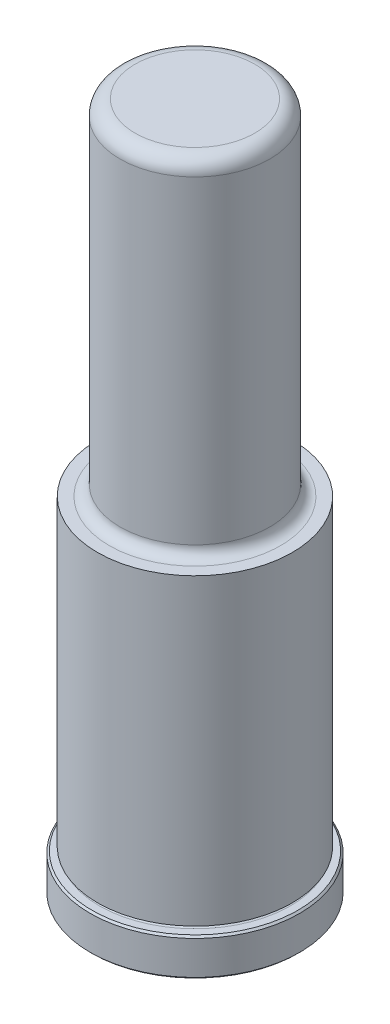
ISO-10303-21;
HEADER;
FILE_DESCRIPTION(('STEP AP214'),'2;1');
FILE_NAME('part.step','',(''),(''),'','','');
FILE_SCHEMA(('AUTOMOTIVE_DESIGN { 1 0 10303 214 1 1 1 1 }'));
ENDSEC;
DATA;
#1=APPLICATION_CONTEXT('core data for automotive mechanical design processes');
#2=APPLICATION_PROTOCOL_DEFINITION('international standard','automotive_design',2000,#1);
#3=PRODUCT_CONTEXT('',#1,'mechanical');
#4=PRODUCT('Part','Part','',(#3));
#5=PRODUCT_RELATED_PRODUCT_CATEGORY('part','',(#4));
#6=PRODUCT_DEFINITION_FORMATION('','',#4);
#7=PRODUCT_DEFINITION_CONTEXT('part definition',#1,'design');
#8=PRODUCT_DEFINITION('design','',#6,#7);
#9=PRODUCT_DEFINITION_SHAPE('','',#8);
#10=(LENGTH_UNIT() NAMED_UNIT(*) SI_UNIT(.MILLI.,.METRE.));
#11=(NAMED_UNIT(*) PLANE_ANGLE_UNIT() SI_UNIT($,.RADIAN.));
#12=(NAMED_UNIT(*) SI_UNIT($,.STERADIAN.) SOLID_ANGLE_UNIT());
#13=UNCERTAINTY_MEASURE_WITH_UNIT(LENGTH_MEASURE(1.E-05),#10,'distance_accuracy_value','');
#14=(GEOMETRIC_REPRESENTATION_CONTEXT(3) GLOBAL_UNCERTAINTY_ASSIGNED_CONTEXT((#13)) GLOBAL_UNIT_ASSIGNED_CONTEXT((#10,
#11,#12)) REPRESENTATION_CONTEXT('',''));
#15=CARTESIAN_POINT('',(0.,0.,0.));
#16=DIRECTION('',(0.,0.,1.));
#17=DIRECTION('',(1.,0.,0.));
#18=AXIS2_PLACEMENT_3D('',#15,#16,#17);
#19=CARTESIAN_POINT('',(0.,0.,0.));
#20=DIRECTION('',(0.,1.,0.));
#21=DIRECTION('',(0.,0.,1.));
#22=AXIS2_PLACEMENT_3D('',#19,#20,#21);
#23=PLANE('',#22);
#24=CARTESIAN_POINT('',(0.,0.,0.));
#25=DIRECTION('',(0.,1.,0.));
#26=DIRECTION('',(0.,0.,1.));
#27=AXIS2_PLACEMENT_3D('',#24,#25,#26);
#28=CIRCLE('',#27,21.844);
#29=CARTESIAN_POINT('',(0.,0.,21.844));
#30=VERTEX_POINT('',#29);
#31=EDGE_CURVE('E46',#30,#30,#28,.F.);
#32=ORIENTED_EDGE('',*,*,#31,.T.);
#33=EDGE_LOOP('',(#32));
#34=FACE_BOUND('',#33,.T.);
#35=ADVANCED_FACE('F31',(#34),#23,.F.);
#36=CARTESIAN_POINT('',(0.,0.,0.));
#37=DIRECTION('',(0.,1.,0.));
#38=DIRECTION('',(0.,0.,1.));
#39=AXIS2_PLACEMENT_3D('',#36,#37,#38);
#40=CYLINDRICAL_SURFACE('',#39,22.225);
#41=CARTESIAN_POINT('',(0.,0.381000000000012,0.));
#42=DIRECTION('',(0.,1.,0.));
#43=DIRECTION('',(0.,0.,1.));
#44=AXIS2_PLACEMENT_3D('',#41,#42,#43);
#45=CIRCLE('',#44,22.225);
#46=CARTESIAN_POINT('',(0.,0.381000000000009,22.225));
#47=VERTEX_POINT('',#46);
#48=EDGE_CURVE('E51',#47,#47,#45,.T.);
#49=ORIENTED_EDGE('',*,*,#48,.T.);
#50=EDGE_LOOP('',(#49));
#51=FACE_BOUND('',#50,.T.);
#52=CARTESIAN_POINT('',(0.,7.54380000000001,0.));
#53=DIRECTION('',(0.,-1.,0.));
#54=DIRECTION('',(0.,0.,-1.));
#55=AXIS2_PLACEMENT_3D('',#52,#53,#54);
#56=CIRCLE('',#55,22.225);
#57=CARTESIAN_POINT('',(0.,7.54380000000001,-22.225));
#58=VERTEX_POINT('',#57);
#59=EDGE_CURVE('E54',#58,#58,#56,.T.);
#60=ORIENTED_EDGE('',*,*,#59,.T.);
#61=EDGE_LOOP('',(#60));
#62=FACE_BOUND('',#61,.T.);
#63=ADVANCED_FACE('F110',(#51,#62),#40,.T.);
#64=CARTESIAN_POINT('',(0.,7.9248,-22.225));
#65=DIRECTION('',(0.,-1.,0.));
#66=DIRECTION('',(0.,0.,-1.));
#67=AXIS2_PLACEMENT_3D('',#64,#65,#66);
#68=PLANE('',#67);
#69=CARTESIAN_POINT('',(0.,7.9248,0.));
#70=DIRECTION('',(0.,-1.,0.));
#71=DIRECTION('',(0.,0.,-1.));
#72=AXIS2_PLACEMENT_3D('',#69,#70,#71);
#73=CIRCLE('',#72,21.844);
#74=CARTESIAN_POINT('',(0.,7.9248,-21.844));
#75=VERTEX_POINT('',#74);
#76=EDGE_CURVE('E42',#75,#75,#73,.F.);
#77=ORIENTED_EDGE('',*,*,#76,.T.);
#78=EDGE_LOOP('',(#77));
#79=FACE_BOUND('',#78,.T.);
#80=CARTESIAN_POINT('',(0.,7.9248,0.));
#81=DIRECTION('',(0.,1.,0.));
#82=DIRECTION('',(0.,0.,1.));
#83=AXIS2_PLACEMENT_3D('',#80,#81,#82);
#84=CIRCLE('',#83,20.2438);
#85=CARTESIAN_POINT('',(0.,7.92479999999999,20.2438));
#86=VERTEX_POINT('',#85);
#87=EDGE_CURVE('E57',#86,#86,#84,.T.);
#88=ORIENTED_EDGE('',*,*,#87,.F.);
#89=EDGE_LOOP('',(#88));
#90=FACE_BOUND('',#89,.T.);
#91=ADVANCED_FACE('F105',(#79,#90),#68,.F.);
#92=CARTESIAN_POINT('',(0.,8.3058,0.));
#93=DIRECTION('',(0.,1.,0.));
#94=DIRECTION('',(0.,0.,1.));
#95=AXIS2_PLACEMENT_3D('',#92,#93,#94);
#96=TOROIDAL_SURFACE('',#95,20.2438,0.380999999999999);
#97=CARTESIAN_POINT('',(0.,8.6868,0.));
#98=DIRECTION('',(0.,1.,0.));
#99=DIRECTION('',(0.,0.,1.));
#100=AXIS2_PLACEMENT_3D('',#97,#98,#99);
#101=CIRCLE('',#100,20.2438);
#102=CARTESIAN_POINT('',(0.,8.68679999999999,20.2438));
#103=VERTEX_POINT('',#102);
#104=EDGE_CURVE('E60',#103,#103,#101,.T.);
#105=ORIENTED_EDGE('',*,*,#104,.F.);
#106=EDGE_LOOP('',(#105));
#107=FACE_BOUND('',#106,.T.);
#108=ORIENTED_EDGE('',*,*,#87,.T.);
#109=EDGE_LOOP('',(#108));
#110=FACE_BOUND('',#109,.T.);
#111=ADVANCED_FACE('F99',(#107,#110),#96,.F.);
#112=CARTESIAN_POINT('',(0.,8.6868,-20.2438));
#113=DIRECTION('',(0.,1.,0.));
#114=DIRECTION('',(0.,0.,1.));
#115=AXIS2_PLACEMENT_3D('',#112,#113,#114);
#116=PLANE('',#115);
#117=CARTESIAN_POINT('',(0.,8.6868,0.));
#118=DIRECTION('',(0.,1.,0.));
#119=DIRECTION('',(0.,0.,1.));
#120=AXIS2_PLACEMENT_3D('',#117,#118,#119);
#121=CIRCLE('',#120,20.6502);
#122=CARTESIAN_POINT('',(0.,8.6868,20.6502));
#123=VERTEX_POINT('',#122);
#124=EDGE_CURVE('E63',#123,#123,#121,.T.);
#125=ORIENTED_EDGE('',*,*,#124,.F.);
#126=EDGE_LOOP('',(#125));
#127=FACE_BOUND('',#126,.T.);
#128=ORIENTED_EDGE('',*,*,#104,.T.);
#129=EDGE_LOOP('',(#128));
#130=FACE_BOUND('',#129,.T.);
#131=ADVANCED_FACE('F93',(#127,#130),#116,.F.);
#132=CARTESIAN_POINT('',(0.,0.,0.));
#133=DIRECTION('',(0.,1.,0.));
#134=DIRECTION('',(0.,0.,1.));
#135=AXIS2_PLACEMENT_3D('',#132,#133,#134);
#136=CYLINDRICAL_SURFACE('',#135,20.6502);
#137=CARTESIAN_POINT('',(0.,73.025,0.));
#138=DIRECTION('',(0.,1.,0.));
#139=DIRECTION('',(0.,0.,1.));
#140=AXIS2_PLACEMENT_3D('',#137,#138,#139);
#141=CIRCLE('',#140,20.6502);
#142=CARTESIAN_POINT('',(0.,73.025,20.6502));
#143=VERTEX_POINT('',#142);
#144=EDGE_CURVE('E66',#143,#143,#141,.T.);
#145=ORIENTED_EDGE('',*,*,#144,.F.);
#146=EDGE_LOOP('',(#145));
#147=FACE_BOUND('',#146,.T.);
#148=ORIENTED_EDGE('',*,*,#124,.T.);
#149=EDGE_LOOP('',(#148));
#150=FACE_BOUND('',#149,.T.);
#151=ADVANCED_FACE('F87',(#147,#150),#136,.T.);
#152=CARTESIAN_POINT('',(0.,73.025,-20.6502));
#153=DIRECTION('',(0.,-1.,0.));
#154=DIRECTION('',(0.,0.,-1.));
#155=AXIS2_PLACEMENT_3D('',#152,#153,#154);
#156=PLANE('',#155);
#157=CARTESIAN_POINT('',(0.,73.025,0.));
#158=DIRECTION('',(0.,1.,0.));
#159=DIRECTION('',(0.,0.,1.));
#160=AXIS2_PLACEMENT_3D('',#157,#158,#159);
#161=CIRCLE('',#160,18.1483);
#162=CARTESIAN_POINT('',(0.,73.025,18.1483));
#163=VERTEX_POINT('',#162);
#164=EDGE_CURVE('E69',#163,#163,#161,.T.);
#165=ORIENTED_EDGE('',*,*,#164,.F.);
#166=EDGE_LOOP('',(#165));
#167=FACE_BOUND('',#166,.T.);
#168=ORIENTED_EDGE('',*,*,#144,.T.);
#169=EDGE_LOOP('',(#168));
#170=FACE_BOUND('',#169,.T.);
#171=ADVANCED_FACE('F81',(#167,#170),#156,.F.);
#172=CARTESIAN_POINT('',(0.,75.311,0.));
#173=DIRECTION('',(0.,1.,0.));
#174=DIRECTION('',(0.,0.,1.));
#175=AXIS2_PLACEMENT_3D('',#172,#173,#174);
#176=TOROIDAL_SURFACE('',#175,18.1483,2.286);
#177=CARTESIAN_POINT('',(0.,75.311,0.));
#178=DIRECTION('',(0.,1.,0.));
#179=DIRECTION('',(0.,0.,1.));
#180=AXIS2_PLACEMENT_3D('',#177,#178,#179);
#181=CIRCLE('',#180,15.8623);
#182=CARTESIAN_POINT('',(0.,75.311,15.8623));
#183=VERTEX_POINT('',#182);
#184=EDGE_CURVE('E72',#183,#183,#181,.T.);
#185=ORIENTED_EDGE('',*,*,#184,.F.);
#186=EDGE_LOOP('',(#185));
#187=FACE_BOUND('',#186,.T.);
#188=ORIENTED_EDGE('',*,*,#164,.T.);
#189=EDGE_LOOP('',(#188));
#190=FACE_BOUND('',#189,.T.);
#191=ADVANCED_FACE('F78',(#187,#190),#176,.F.);
#192=CARTESIAN_POINT('',(0.,0.,0.));
#193=DIRECTION('',(0.,1.,0.));
#194=DIRECTION('',(0.,0.,1.));
#195=AXIS2_PLACEMENT_3D('',#192,#193,#194);
#196=CYLINDRICAL_SURFACE('',#195,15.8623);
#197=CARTESIAN_POINT('',(0.,142.875,0.));
#198=DIRECTION('',(0.,-1.,0.));
#199=DIRECTION('',(0.,0.,-1.));
#200=AXIS2_PLACEMENT_3D('',#197,#198,#199);
#201=CIRCLE('',#200,15.8623);
#202=CARTESIAN_POINT('',(0.,142.875,-15.8623));
#203=VERTEX_POINT('',#202);
#204=EDGE_CURVE('E10',#203,#203,#201,.T.);
#205=ORIENTED_EDGE('',*,*,#204,.T.);
#206=EDGE_LOOP('',(#205));
#207=FACE_BOUND('',#206,.T.);
#208=ORIENTED_EDGE('',*,*,#184,.T.);
#209=EDGE_LOOP('',(#208));
#210=FACE_BOUND('',#209,.T.);
#211=ADVANCED_FACE('F76',(#207,#210),#196,.T.);
#212=CARTESIAN_POINT('',(0.,146.05,-15.8623));
#213=DIRECTION('',(0.,-1.,0.));
#214=DIRECTION('',(0.,0.,-1.));
#215=AXIS2_PLACEMENT_3D('',#212,#213,#214);
#216=PLANE('',#215);
#217=CARTESIAN_POINT('',(0.,146.05,0.));
#218=DIRECTION('',(0.,-1.,0.));
#219=DIRECTION('',(0.,0.,-1.));
#220=AXIS2_PLACEMENT_3D('',#217,#218,#219);
#221=CIRCLE('',#220,12.6873);
#222=CARTESIAN_POINT('',(0.,146.05,-12.6873));
#223=VERTEX_POINT('',#222);
#224=EDGE_CURVE('E38',#223,#223,#221,.F.);
#225=ORIENTED_EDGE('',*,*,#224,.T.);
#226=EDGE_LOOP('',(#225));
#227=FACE_BOUND('',#226,.T.);
#228=ADVANCED_FACE('F127',(#227),#216,.F.);
#229=CARTESIAN_POINT('',(0.,0.381000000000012,0.));
#230=DIRECTION('',(0.,1.,0.));
#231=DIRECTION('',(0.,0.,1.));
#232=AXIS2_PLACEMENT_3D('',#229,#230,#231);
#233=CONICAL_SURFACE('',#232,22.225,0.785398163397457);
#234=ORIENTED_EDGE('',*,*,#31,.F.);
#235=EDGE_LOOP('',(#234));
#236=FACE_BOUND('',#235,.T.);
#237=ORIENTED_EDGE('',*,*,#48,.F.);
#238=EDGE_LOOP('',(#237));
#239=FACE_BOUND('',#238,.T.);
#240=ADVANCED_FACE('F124',(#236,#239),#233,.T.);
#241=CARTESIAN_POINT('',(0.,7.9248,0.));
#242=DIRECTION('',(0.,-1.,0.));
#243=DIRECTION('',(0.,0.,-1.));
#244=AXIS2_PLACEMENT_3D('',#241,#242,#243);
#245=CONICAL_SURFACE('',#244,21.844,0.785398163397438);
#246=ORIENTED_EDGE('',*,*,#59,.F.);
#247=EDGE_LOOP('',(#246));
#248=FACE_BOUND('',#247,.T.);
#249=ORIENTED_EDGE('',*,*,#76,.F.);
#250=EDGE_LOOP('',(#249));
#251=FACE_BOUND('',#250,.T.);
#252=ADVANCED_FACE('F126',(#248,#251),#245,.T.);
#253=CARTESIAN_POINT('',(0.,142.875,0.));
#254=DIRECTION('',(0.,-1.,0.));
#255=DIRECTION('',(0.,0.,-1.));
#256=AXIS2_PLACEMENT_3D('',#253,#254,#255);
#257=TOROIDAL_SURFACE('',#256,12.6873,3.175);
#258=ORIENTED_EDGE('',*,*,#204,.F.);
#259=EDGE_LOOP('',(#258));
#260=FACE_BOUND('',#259,.T.);
#261=ORIENTED_EDGE('',*,*,#224,.F.);
#262=EDGE_LOOP('',(#261));
#263=FACE_BOUND('',#262,.T.);
#264=ADVANCED_FACE('F33',(#260,#263),#257,.T.);
#265=CLOSED_SHELL('',(#35,#63,#91,#111,#131,#151,#171,#191,#211,#228,#240,#252,#264));
#266=MANIFOLD_SOLID_BREP('B2',#265);
#267=ADVANCED_BREP_SHAPE_REPRESENTATION('',(#18,#266),#14);
#268=SHAPE_DEFINITION_REPRESENTATION(#9,#267);
ENDSEC;
END-ISO-10303-21;
